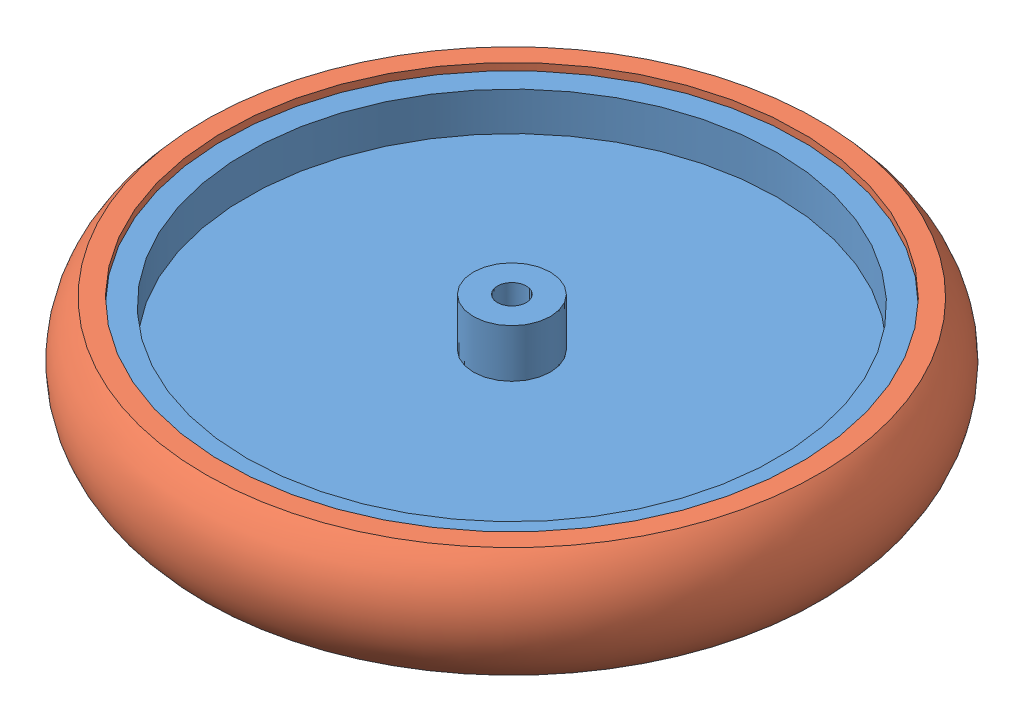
SolidWorks assembly Roue.SLDASM, configuration Défaut (file format 5000). Lengths in mm.
Overall size (78.63 11.74 78.63).
2 component instances, 2 part files, 2 mates.
Components (placement in the parent):
- Jante2-1: Jante2.SLDPRT [Défaut] at (-0.6878 -5.2812 0) size (62.55 11 62.54)
- pneu-1: pneu.SLDPRT [Défaut] at (30.7241 5.4571 5.1714) x (0 -1 0) z (-0.162444 0 0.986718) size (11.48 68.42 68.42)
Mates (geometry in assembly coordinates):
- Coaxiale1: concentric: circle of Jante2-1; circle of pneu-1
- Coïncidente2: coincident anti-aligned: plane of Jante2-1 through (-0.6878 -5.2812 0) normal (0 -1 0); plane of pneu-1 through (28.7507 -5.2812 4.8465) normal (0 1 0)
